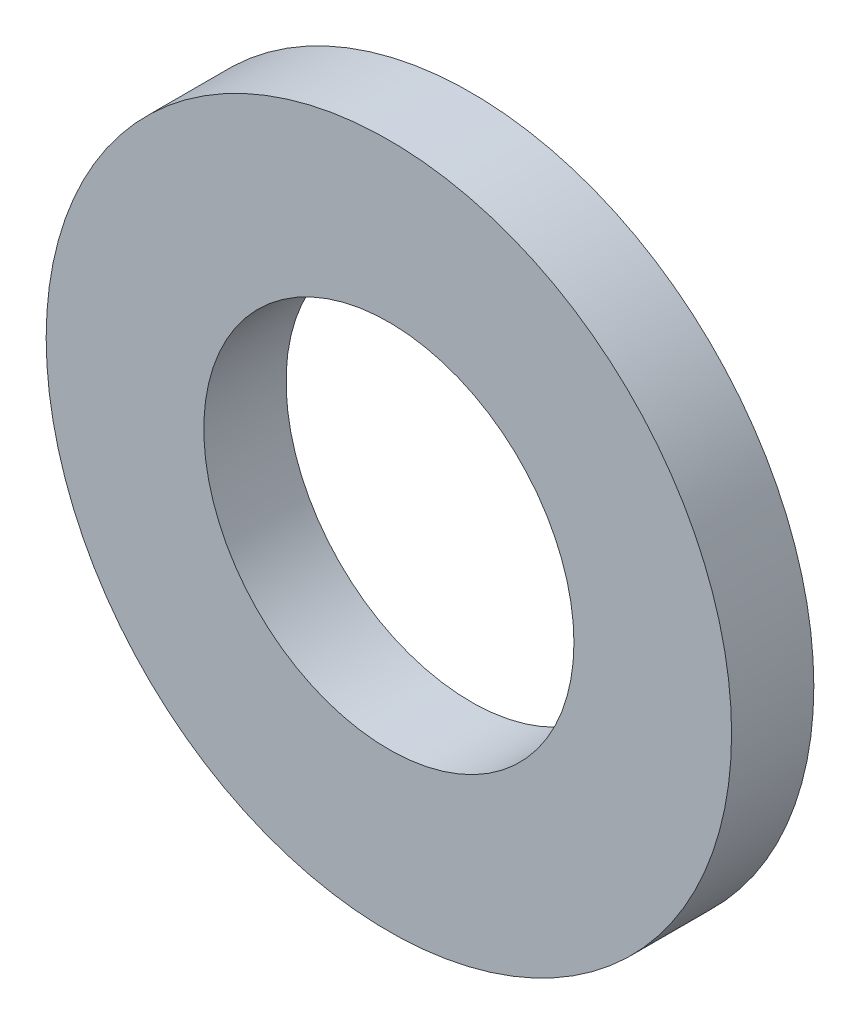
ISO-10303-21;
HEADER;
FILE_DESCRIPTION(('STEP AP214'),'2;1');
FILE_NAME('part.step','',(''),(''),'','','');
FILE_SCHEMA(('AUTOMOTIVE_DESIGN { 1 0 10303 214 1 1 1 1 }'));
ENDSEC;
DATA;
#1=APPLICATION_CONTEXT('core data for automotive mechanical design processes');
#2=APPLICATION_PROTOCOL_DEFINITION('international standard','automotive_design',2000,#1);
#3=PRODUCT_CONTEXT('',#1,'mechanical');
#4=PRODUCT('Part','Part','',(#3));
#5=PRODUCT_RELATED_PRODUCT_CATEGORY('part','',(#4));
#6=PRODUCT_DEFINITION_FORMATION('','',#4);
#7=PRODUCT_DEFINITION_CONTEXT('part definition',#1,'design');
#8=PRODUCT_DEFINITION('design','',#6,#7);
#9=PRODUCT_DEFINITION_SHAPE('','',#8);
#10=(LENGTH_UNIT() NAMED_UNIT(*) SI_UNIT(.MILLI.,.METRE.));
#11=(NAMED_UNIT(*) PLANE_ANGLE_UNIT() SI_UNIT($,.RADIAN.));
#12=(NAMED_UNIT(*) SI_UNIT($,.STERADIAN.) SOLID_ANGLE_UNIT());
#13=UNCERTAINTY_MEASURE_WITH_UNIT(LENGTH_MEASURE(1.E-05),#10,'distance_accuracy_value','');
#14=(GEOMETRIC_REPRESENTATION_CONTEXT(3) GLOBAL_UNCERTAINTY_ASSIGNED_CONTEXT((#13)) GLOBAL_UNIT_ASSIGNED_CONTEXT((#10,
#11,#12)) REPRESENTATION_CONTEXT('',''));
#15=CARTESIAN_POINT('',(0.,0.,0.));
#16=DIRECTION('',(0.,0.,1.));
#17=DIRECTION('',(1.,0.,0.));
#18=AXIS2_PLACEMENT_3D('',#15,#16,#17);
#19=CARTESIAN_POINT('',(0.,0.,-6.));
#20=DIRECTION('',(0.,0.,1.));
#21=DIRECTION('',(1.,0.,0.));
#22=AXIS2_PLACEMENT_3D('',#19,#20,#21);
#23=CYLINDRICAL_SURFACE('',#22,25.);
#24=CARTESIAN_POINT('',(0.,0.,-6.));
#25=DIRECTION('',(0.,0.,1.));
#26=DIRECTION('',(1.,0.,0.));
#27=AXIS2_PLACEMENT_3D('',#24,#25,#26);
#28=CIRCLE('',#27,25.);
#29=CARTESIAN_POINT('',(25.,0.,-6.));
#30=VERTEX_POINT('',#29);
#31=EDGE_CURVE('E10',#30,#30,#28,.T.);
#32=ORIENTED_EDGE('',*,*,#31,.T.);
#33=EDGE_LOOP('',(#32));
#34=FACE_BOUND('',#33,.T.);
#35=CARTESIAN_POINT('',(0.,0.,0.));
#36=DIRECTION('',(0.,0.,1.));
#37=DIRECTION('',(1.,0.,0.));
#38=AXIS2_PLACEMENT_3D('',#35,#36,#37);
#39=CIRCLE('',#38,25.);
#40=CARTESIAN_POINT('',(25.,0.,0.));
#41=VERTEX_POINT('',#40);
#42=EDGE_CURVE('E367',#41,#41,#39,.T.);
#43=ORIENTED_EDGE('',*,*,#42,.F.);
#44=EDGE_LOOP('',(#43));
#45=FACE_BOUND('',#44,.T.);
#46=ADVANCED_FACE('F361',(#34,#45),#23,.T.);
#47=CARTESIAN_POINT('',(0.,0.,-6.));
#48=DIRECTION('',(0.,0.,1.));
#49=DIRECTION('',(1.,0.,0.));
#50=AXIS2_PLACEMENT_3D('',#47,#48,#49);
#51=PLANE('',#50);
#52=CARTESIAN_POINT('',(0.,0.,-6.));
#53=DIRECTION('',(0.,0.,1.));
#54=DIRECTION('',(1.,0.,0.));
#55=AXIS2_PLACEMENT_3D('',#52,#53,#54);
#56=CIRCLE('',#55,13.5);
#57=CARTESIAN_POINT('',(13.5,0.,-6.));
#58=VERTEX_POINT('',#57);
#59=EDGE_CURVE('E371',#58,#58,#56,.T.);
#60=ORIENTED_EDGE('',*,*,#59,.T.);
#61=EDGE_LOOP('',(#60));
#62=FACE_BOUND('',#61,.T.);
#63=ORIENTED_EDGE('',*,*,#31,.F.);
#64=EDGE_LOOP('',(#63));
#65=FACE_BOUND('',#64,.T.);
#66=ADVANCED_FACE('F385',(#62,#65),#51,.F.);
#67=CARTESIAN_POINT('',(0.,0.,0.));
#68=DIRECTION('',(0.,0.,1.));
#69=DIRECTION('',(1.,0.,0.));
#70=AXIS2_PLACEMENT_3D('',#67,#68,#69);
#71=PLANE('',#70);
#72=CARTESIAN_POINT('',(0.,0.,0.));
#73=DIRECTION('',(0.,0.,1.));
#74=DIRECTION('',(1.,0.,0.));
#75=AXIS2_PLACEMENT_3D('',#72,#73,#74);
#76=CIRCLE('',#75,13.5);
#77=CARTESIAN_POINT('',(13.5,0.,0.));
#78=VERTEX_POINT('',#77);
#79=EDGE_CURVE('E375',#78,#78,#76,.T.);
#80=ORIENTED_EDGE('',*,*,#79,.F.);
#81=EDGE_LOOP('',(#80));
#82=FACE_BOUND('',#81,.T.);
#83=ORIENTED_EDGE('',*,*,#42,.T.);
#84=EDGE_LOOP('',(#83));
#85=FACE_BOUND('',#84,.T.);
#86=ADVANCED_FACE('F383',(#82,#85),#71,.T.);
#87=CARTESIAN_POINT('',(0.,0.,-6.));
#88=DIRECTION('',(0.,0.,1.));
#89=DIRECTION('',(1.,0.,0.));
#90=AXIS2_PLACEMENT_3D('',#87,#88,#89);
#91=CYLINDRICAL_SURFACE('',#90,13.5);
#92=ORIENTED_EDGE('',*,*,#59,.F.);
#93=EDGE_LOOP('',(#92));
#94=FACE_BOUND('',#93,.T.);
#95=ORIENTED_EDGE('',*,*,#79,.T.);
#96=EDGE_LOOP('',(#95));
#97=FACE_BOUND('',#96,.T.);
#98=ADVANCED_FACE('F381',(#94,#97),#91,.F.);
#99=CLOSED_SHELL('',(#46,#66,#86,#98));
#100=MANIFOLD_SOLID_BREP('B2',#99);
#101=ADVANCED_BREP_SHAPE_REPRESENTATION('',(#18,#100),#14);
#102=SHAPE_DEFINITION_REPRESENTATION(#9,#101);
ENDSEC;
END-ISO-10303-21;
